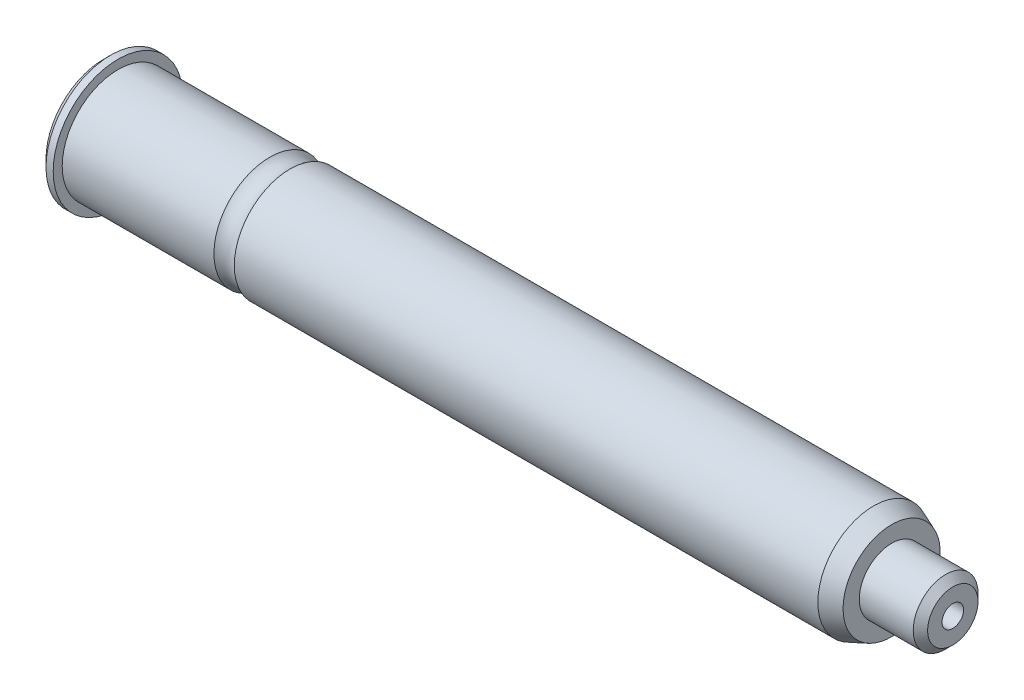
ISO-10303-21;
HEADER;
FILE_DESCRIPTION(('STEP AP214'),'2;1');
FILE_NAME('part.step','',(''),(''),'','','');
FILE_SCHEMA(('AUTOMOTIVE_DESIGN { 1 0 10303 214 1 1 1 1 }'));
ENDSEC;
DATA;
#1=APPLICATION_CONTEXT('core data for automotive mechanical design processes');
#2=APPLICATION_PROTOCOL_DEFINITION('international standard','automotive_design',2000,#1);
#3=PRODUCT_CONTEXT('',#1,'mechanical');
#4=PRODUCT('Part','Part','',(#3));
#5=PRODUCT_RELATED_PRODUCT_CATEGORY('part','',(#4));
#6=PRODUCT_DEFINITION_FORMATION('','',#4);
#7=PRODUCT_DEFINITION_CONTEXT('part definition',#1,'design');
#8=PRODUCT_DEFINITION('design','',#6,#7);
#9=PRODUCT_DEFINITION_SHAPE('','',#8);
#10=(LENGTH_UNIT() NAMED_UNIT(*) SI_UNIT(.MILLI.,.METRE.));
#11=(NAMED_UNIT(*) PLANE_ANGLE_UNIT() SI_UNIT($,.RADIAN.));
#12=(NAMED_UNIT(*) SI_UNIT($,.STERADIAN.) SOLID_ANGLE_UNIT());
#13=UNCERTAINTY_MEASURE_WITH_UNIT(LENGTH_MEASURE(1.E-05),#10,'distance_accuracy_value','');
#14=(GEOMETRIC_REPRESENTATION_CONTEXT(3) GLOBAL_UNCERTAINTY_ASSIGNED_CONTEXT((#13)) GLOBAL_UNIT_ASSIGNED_CONTEXT((#10,
#11,#12)) REPRESENTATION_CONTEXT('',''));
#15=CARTESIAN_POINT('',(0.,0.,0.));
#16=DIRECTION('',(0.,0.,1.));
#17=DIRECTION('',(1.,0.,0.));
#18=AXIS2_PLACEMENT_3D('',#15,#16,#17);
#19=CARTESIAN_POINT('',(0.,0.,0.));
#20=DIRECTION('',(-1.,0.,0.));
#21=DIRECTION('',(0.,0.,1.));
#22=AXIS2_PLACEMENT_3D('',#19,#20,#21);
#23=PLANE('',#22);
#24=CARTESIAN_POINT('',(0.,0.,0.));
#25=DIRECTION('',(-1.,0.,0.));
#26=DIRECTION('',(0.,0.,1.));
#27=AXIS2_PLACEMENT_3D('',#24,#25,#26);
#28=CIRCLE('',#27,7.99999999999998);
#29=CARTESIAN_POINT('',(0.,0.,7.99999999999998));
#30=VERTEX_POINT('',#29);
#31=EDGE_CURVE('E85',#30,#30,#28,.T.);
#32=ORIENTED_EDGE('',*,*,#31,.T.);
#33=EDGE_LOOP('',(#32));
#34=FACE_BOUND('',#33,.T.);
#35=ADVANCED_FACE('F40',(#34),#23,.T.);
#36=CARTESIAN_POINT('',(-10.,0.,0.));
#37=DIRECTION('',(-1.,0.,0.));
#38=DIRECTION('',(0.,0.,1.));
#39=AXIS2_PLACEMENT_3D('',#36,#37,#38);
#40=CYLINDRICAL_SURFACE('',#39,9.);
#41=CARTESIAN_POINT('',(1.00000000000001,0.,0.));
#42=DIRECTION('',(-1.,0.,0.));
#43=DIRECTION('',(0.,0.,1.));
#44=AXIS2_PLACEMENT_3D('',#41,#42,#43);
#45=CIRCLE('',#44,9.);
#46=CARTESIAN_POINT('',(1.00000000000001,0.,9.));
#47=VERTEX_POINT('',#46);
#48=EDGE_CURVE('E88',#47,#47,#45,.F.);
#49=ORIENTED_EDGE('',*,*,#48,.T.);
#50=EDGE_LOOP('',(#49));
#51=FACE_BOUND('',#50,.T.);
#52=CARTESIAN_POINT('',(2.,0.,0.));
#53=DIRECTION('',(-1.,0.,0.));
#54=DIRECTION('',(0.,0.,1.));
#55=AXIS2_PLACEMENT_3D('',#52,#53,#54);
#56=CIRCLE('',#55,9.);
#57=CARTESIAN_POINT('',(2.,0.,9.));
#58=VERTEX_POINT('',#57);
#59=EDGE_CURVE('E82',#58,#58,#56,.T.);
#60=ORIENTED_EDGE('',*,*,#59,.T.);
#61=EDGE_LOOP('',(#60));
#62=FACE_BOUND('',#61,.T.);
#63=ADVANCED_FACE('F106',(#51,#62),#40,.T.);
#64=CARTESIAN_POINT('',(2.,-9.,0.));
#65=DIRECTION('',(1.,0.,0.));
#66=DIRECTION('',(0.,0.,-1.));
#67=AXIS2_PLACEMENT_3D('',#64,#65,#66);
#68=PLANE('',#67);
#69=CARTESIAN_POINT('',(2.,0.,0.));
#70=DIRECTION('',(-1.,0.,0.));
#71=DIRECTION('',(0.,0.,1.));
#72=AXIS2_PLACEMENT_3D('',#69,#70,#71);
#73=CIRCLE('',#72,7.75);
#74=CARTESIAN_POINT('',(2.,0.,7.75));
#75=VERTEX_POINT('',#74);
#76=EDGE_CURVE('E79',#75,#75,#73,.T.);
#77=ORIENTED_EDGE('',*,*,#76,.T.);
#78=EDGE_LOOP('',(#77));
#79=FACE_BOUND('',#78,.T.);
#80=ORIENTED_EDGE('',*,*,#59,.F.);
#81=EDGE_LOOP('',(#80));
#82=FACE_BOUND('',#81,.T.);
#83=ADVANCED_FACE('F112',(#79,#82),#68,.T.);
#84=CARTESIAN_POINT('',(-10.,0.,0.));
#85=DIRECTION('',(-1.,0.,0.));
#86=DIRECTION('',(0.,0.,1.));
#87=AXIS2_PLACEMENT_3D('',#84,#85,#86);
#88=CYLINDRICAL_SURFACE('',#87,7.75);
#89=CARTESIAN_POINT('',(23.0857864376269,0.,0.));
#90=DIRECTION('',(-1.,0.,0.));
#91=DIRECTION('',(0.,0.,1.));
#92=AXIS2_PLACEMENT_3D('',#89,#90,#91);
#93=CIRCLE('',#92,7.75);
#94=CARTESIAN_POINT('',(23.0857864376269,0.,7.75));
#95=VERTEX_POINT('',#94);
#96=EDGE_CURVE('E76',#95,#95,#93,.T.);
#97=ORIENTED_EDGE('',*,*,#96,.T.);
#98=EDGE_LOOP('',(#97));
#99=FACE_BOUND('',#98,.T.);
#100=ORIENTED_EDGE('',*,*,#76,.F.);
#101=EDGE_LOOP('',(#100));
#102=FACE_BOUND('',#101,.T.);
#103=ADVANCED_FACE('F118',(#99,#102),#88,.T.);
#104=CARTESIAN_POINT('',(24.5,0.,0.));
#105=DIRECTION('',(-1.,0.,0.));
#106=DIRECTION('',(0.,0.,1.));
#107=AXIS2_PLACEMENT_3D('',#104,#105,#106);
#108=TOROIDAL_SURFACE('',#107,9.5,2.25);
#109=CARTESIAN_POINT('',(25.9142135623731,0.,0.));
#110=DIRECTION('',(-1.,0.,0.));
#111=DIRECTION('',(0.,0.,1.));
#112=AXIS2_PLACEMENT_3D('',#109,#110,#111);
#113=CIRCLE('',#112,7.75);
#114=CARTESIAN_POINT('',(25.9142135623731,0.,7.75));
#115=VERTEX_POINT('',#114);
#116=EDGE_CURVE('E73',#115,#115,#113,.T.);
#117=ORIENTED_EDGE('',*,*,#116,.T.);
#118=EDGE_LOOP('',(#117));
#119=FACE_BOUND('',#118,.T.);
#120=ORIENTED_EDGE('',*,*,#96,.F.);
#121=EDGE_LOOP('',(#120));
#122=FACE_BOUND('',#121,.T.);
#123=ADVANCED_FACE('F122',(#119,#122),#108,.F.);
#124=CARTESIAN_POINT('',(-10.,0.,0.));
#125=DIRECTION('',(-1.,0.,0.));
#126=DIRECTION('',(0.,0.,1.));
#127=AXIS2_PLACEMENT_3D('',#124,#125,#126);
#128=CYLINDRICAL_SURFACE('',#127,7.75);
#129=CARTESIAN_POINT('',(107.,0.,0.));
#130=DIRECTION('',(-1.,0.,0.));
#131=DIRECTION('',(0.,0.,1.));
#132=AXIS2_PLACEMENT_3D('',#129,#130,#131);
#133=CIRCLE('',#132,7.75);
#134=CARTESIAN_POINT('',(107.,0.,7.75));
#135=VERTEX_POINT('',#134);
#136=EDGE_CURVE('E70',#135,#135,#133,.T.);
#137=ORIENTED_EDGE('',*,*,#136,.T.);
#138=EDGE_LOOP('',(#137));
#139=FACE_BOUND('',#138,.T.);
#140=ORIENTED_EDGE('',*,*,#116,.F.);
#141=EDGE_LOOP('',(#140));
#142=FACE_BOUND('',#141,.T.);
#143=ADVANCED_FACE('F126',(#139,#142),#128,.T.);
#144=CARTESIAN_POINT('',(107.,0.,0.));
#145=DIRECTION('',(-1.,0.,0.));
#146=DIRECTION('',(0.,0.,1.));
#147=AXIS2_PLACEMENT_3D('',#144,#145,#146);
#148=CONICAL_SURFACE('',#147,7.75,0.380506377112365);
#149=CARTESIAN_POINT('',(109.5,0.,0.));
#150=DIRECTION('',(-1.,0.,0.));
#151=DIRECTION('',(0.,0.,1.));
#152=AXIS2_PLACEMENT_3D('',#149,#150,#151);
#153=CIRCLE('',#152,6.75);
#154=CARTESIAN_POINT('',(109.5,0.,6.75));
#155=VERTEX_POINT('',#154);
#156=EDGE_CURVE('E63',#155,#155,#153,.T.);
#157=ORIENTED_EDGE('',*,*,#156,.T.);
#158=EDGE_LOOP('',(#157));
#159=FACE_BOUND('',#158,.T.);
#160=ORIENTED_EDGE('',*,*,#136,.F.);
#161=EDGE_LOOP('',(#160));
#162=FACE_BOUND('',#161,.T.);
#163=ADVANCED_FACE('F130',(#159,#162),#148,.T.);
#164=CARTESIAN_POINT('',(109.5,-6.75,0.));
#165=DIRECTION('',(1.,0.,0.));
#166=DIRECTION('',(0.,0.,-1.));
#167=AXIS2_PLACEMENT_3D('',#164,#165,#166);
#168=PLANE('',#167);
#169=CARTESIAN_POINT('',(109.5,0.,0.));
#170=DIRECTION('',(-1.,0.,0.));
#171=DIRECTION('',(0.,0.,1.));
#172=AXIS2_PLACEMENT_3D('',#169,#170,#171);
#173=CIRCLE('',#172,4.5);
#174=CARTESIAN_POINT('',(109.5,0.,4.5));
#175=VERTEX_POINT('',#174);
#176=EDGE_CURVE('E59',#175,#175,#173,.T.);
#177=ORIENTED_EDGE('',*,*,#176,.T.);
#178=EDGE_LOOP('',(#177));
#179=FACE_BOUND('',#178,.T.);
#180=ORIENTED_EDGE('',*,*,#156,.F.);
#181=EDGE_LOOP('',(#180));
#182=FACE_BOUND('',#181,.T.);
#183=ADVANCED_FACE('F134',(#179,#182),#168,.T.);
#184=CARTESIAN_POINT('',(-10.,0.,0.));
#185=DIRECTION('',(-1.,0.,0.));
#186=DIRECTION('',(0.,0.,1.));
#187=AXIS2_PLACEMENT_3D('',#184,#185,#186);
#188=CYLINDRICAL_SURFACE('',#187,4.5);
#189=CARTESIAN_POINT('',(117.,0.,0.));
#190=DIRECTION('',(1.,0.,0.));
#191=DIRECTION('',(0.,0.,-1.));
#192=AXIS2_PLACEMENT_3D('',#189,#190,#191);
#193=CIRCLE('',#192,4.5);
#194=CARTESIAN_POINT('',(117.,0.,-4.5));
#195=VERTEX_POINT('',#194);
#196=EDGE_CURVE('E47',#195,#195,#193,.F.);
#197=ORIENTED_EDGE('',*,*,#196,.T.);
#198=EDGE_LOOP('',(#197));
#199=FACE_BOUND('',#198,.T.);
#200=ORIENTED_EDGE('',*,*,#176,.F.);
#201=EDGE_LOOP('',(#200));
#202=FACE_BOUND('',#201,.T.);
#203=ADVANCED_FACE('F93',(#199,#202),#188,.T.);
#204=CARTESIAN_POINT('',(118.,-4.5,0.));
#205=DIRECTION('',(1.,0.,0.));
#206=DIRECTION('',(0.,0.,-1.));
#207=AXIS2_PLACEMENT_3D('',#204,#205,#206);
#208=PLANE('',#207);
#209=CARTESIAN_POINT('',(118.,0.,0.));
#210=DIRECTION('',(1.,0.,0.));
#211=DIRECTION('',(0.,0.,-1.));
#212=AXIS2_PLACEMENT_3D('',#209,#210,#211);
#213=CIRCLE('',#212,1.5);
#214=CARTESIAN_POINT('',(118.,0.,-1.5));
#215=VERTEX_POINT('',#214);
#216=EDGE_CURVE('E60',#215,#215,#213,.T.);
#217=ORIENTED_EDGE('',*,*,#216,.F.);
#218=EDGE_LOOP('',(#217));
#219=FACE_BOUND('',#218,.T.);
#220=CARTESIAN_POINT('',(118.,0.,0.));
#221=DIRECTION('',(1.,0.,0.));
#222=DIRECTION('',(0.,0.,-1.));
#223=AXIS2_PLACEMENT_3D('',#220,#221,#222);
#224=CIRCLE('',#223,3.49999999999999);
#225=CARTESIAN_POINT('',(118.,0.,-3.49999999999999));
#226=VERTEX_POINT('',#225);
#227=EDGE_CURVE('E11',#226,#226,#224,.T.);
#228=ORIENTED_EDGE('',*,*,#227,.T.);
#229=EDGE_LOOP('',(#228));
#230=FACE_BOUND('',#229,.T.);
#231=ADVANCED_FACE('F102',(#219,#230),#208,.T.);
#232=CARTESIAN_POINT('',(0.,0.,0.));
#233=DIRECTION('',(1.,0.,0.));
#234=DIRECTION('',(0.,0.,-1.));
#235=AXIS2_PLACEMENT_3D('',#232,#233,#234);
#236=CONICAL_SURFACE('',#235,7.99999999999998,0.785398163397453);
#237=ORIENTED_EDGE('',*,*,#48,.F.);
#238=EDGE_LOOP('',(#237));
#239=FACE_BOUND('',#238,.T.);
#240=ORIENTED_EDGE('',*,*,#31,.F.);
#241=EDGE_LOOP('',(#240));
#242=FACE_BOUND('',#241,.T.);
#243=ADVANCED_FACE('F97',(#239,#242),#236,.T.);
#244=CARTESIAN_POINT('',(117.,0.,0.));
#245=DIRECTION('',(-1.,0.,0.));
#246=DIRECTION('',(0.,0.,1.));
#247=AXIS2_PLACEMENT_3D('',#244,#245,#246);
#248=CONICAL_SURFACE('',#247,4.5,0.785398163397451);
#249=ORIENTED_EDGE('',*,*,#227,.F.);
#250=EDGE_LOOP('',(#249));
#251=FACE_BOUND('',#250,.T.);
#252=ORIENTED_EDGE('',*,*,#196,.F.);
#253=EDGE_LOOP('',(#252));
#254=FACE_BOUND('',#253,.T.);
#255=ADVANCED_FACE('F42',(#251,#254),#248,.T.);
#256=CARTESIAN_POINT('',(93.,0.,0.));
#257=DIRECTION('',(1.,0.,0.));
#258=DIRECTION('',(0.,0.,-1.));
#259=AXIS2_PLACEMENT_3D('',#256,#257,#258);
#260=CONICAL_SURFACE('',#259,1.5,1.02974425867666);
#261=CARTESIAN_POINT('',(92.0987090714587,0.,0.));
#262=VERTEX_POINT('',#261);
#263=VERTEX_LOOP('',#262);
#264=FACE_BOUND('',#263,.T.);
#265=CARTESIAN_POINT('',(93.,0.,0.));
#266=DIRECTION('',(1.,0.,0.));
#267=DIRECTION('',(0.,0.,-1.));
#268=AXIS2_PLACEMENT_3D('',#265,#266,#267);
#269=CIRCLE('',#268,1.5);
#270=CARTESIAN_POINT('',(93.,0.,-1.5));
#271=VERTEX_POINT('',#270);
#272=EDGE_CURVE('E57',#271,#271,#269,.T.);
#273=ORIENTED_EDGE('',*,*,#272,.T.);
#274=EDGE_LOOP('',(#273));
#275=FACE_BOUND('',#274,.T.);
#276=ADVANCED_FACE('F50',(#264,#275),#260,.F.);
#277=CARTESIAN_POINT('',(118.,0.,0.));
#278=DIRECTION('',(1.,0.,0.));
#279=DIRECTION('',(0.,0.,-1.));
#280=AXIS2_PLACEMENT_3D('',#277,#278,#279);
#281=CYLINDRICAL_SURFACE('',#280,1.5);
#282=ORIENTED_EDGE('',*,*,#272,.F.);
#283=EDGE_LOOP('',(#282));
#284=FACE_BOUND('',#283,.T.);
#285=ORIENTED_EDGE('',*,*,#216,.T.);
#286=EDGE_LOOP('',(#285));
#287=FACE_BOUND('',#286,.T.);
#288=ADVANCED_FACE('F53',(#284,#287),#281,.F.);
#289=CLOSED_SHELL('',(#35,#63,#83,#103,#123,#143,#163,#183,#203,#231,#243,#255,#276,#288));
#290=MANIFOLD_SOLID_BREP('B2',#289);
#291=ADVANCED_BREP_SHAPE_REPRESENTATION('',(#18,#290),#14);
#292=SHAPE_DEFINITION_REPRESENTATION(#9,#291);
ENDSEC;
END-ISO-10303-21;
